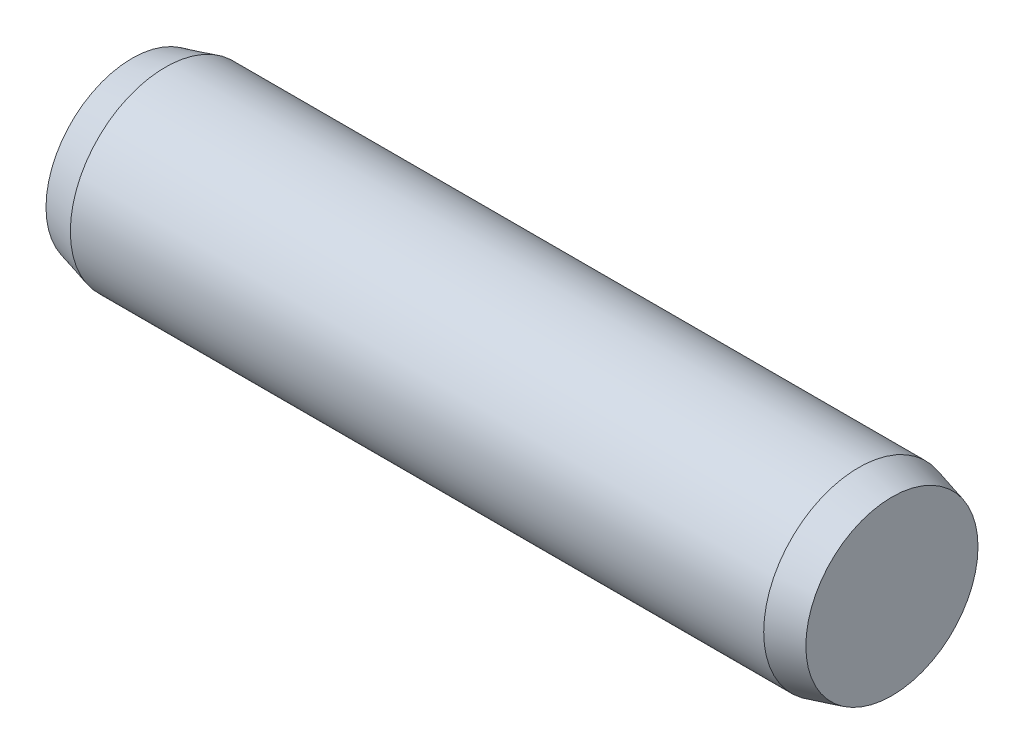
from build123d import *


with BuildPart() as part:
    # Sketch1 → Base-Revolve (revolve)
    with BuildSketch(Plane.XY, mode=Mode.PRIVATE) as base_revolve_sk:
        Polygon((-4, 0), (4, 0), (4, 0.906217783), (3.65, 1), (-3.65, 1), (-4, 0.906217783), align=None)
    revolve(base_revolve_sk.sketch.rotate(Axis((-6.35, 0, 0), (1, 0, 0)), 90), axis=Axis((-6.35, 0, 0), (1, 0, 0)))


solid = part.part
